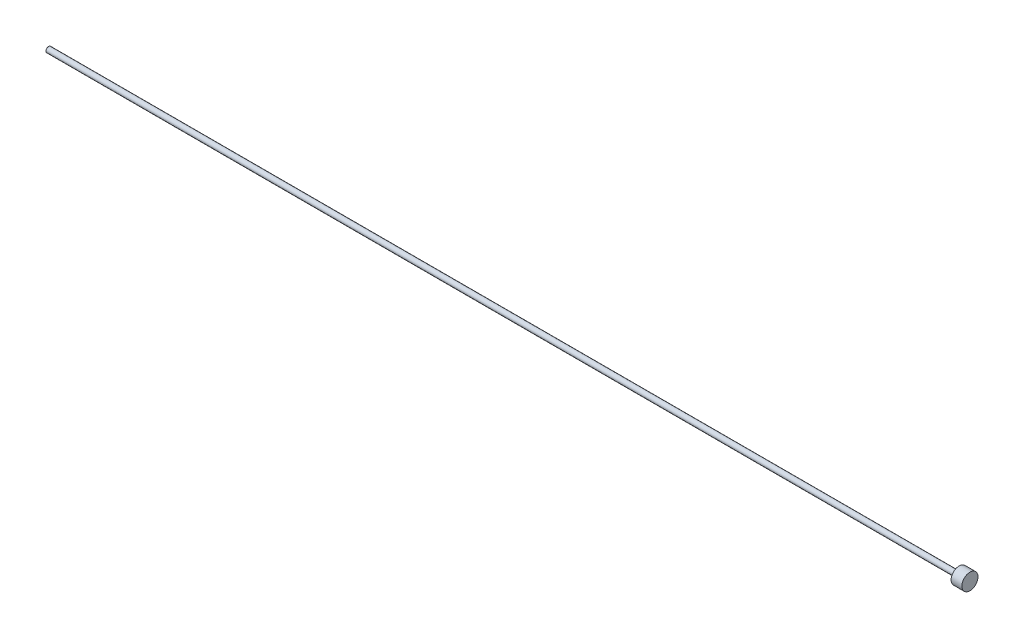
ISO-10303-21;
HEADER;
FILE_DESCRIPTION(('STEP AP214'),'2;1');
FILE_NAME('part.step','',(''),(''),'','','');
FILE_SCHEMA(('AUTOMOTIVE_DESIGN { 1 0 10303 214 1 1 1 1 }'));
ENDSEC;
DATA;
#1=APPLICATION_CONTEXT('core data for automotive mechanical design processes');
#2=APPLICATION_PROTOCOL_DEFINITION('international standard','automotive_design',2000,#1);
#3=PRODUCT_CONTEXT('',#1,'mechanical');
#4=PRODUCT('Part','Part','',(#3));
#5=PRODUCT_RELATED_PRODUCT_CATEGORY('part','',(#4));
#6=PRODUCT_DEFINITION_FORMATION('','',#4);
#7=PRODUCT_DEFINITION_CONTEXT('part definition',#1,'design');
#8=PRODUCT_DEFINITION('design','',#6,#7);
#9=PRODUCT_DEFINITION_SHAPE('','',#8);
#10=(LENGTH_UNIT() NAMED_UNIT(*) SI_UNIT(.MILLI.,.METRE.));
#11=(NAMED_UNIT(*) PLANE_ANGLE_UNIT() SI_UNIT($,.RADIAN.));
#12=(NAMED_UNIT(*) SI_UNIT($,.STERADIAN.) SOLID_ANGLE_UNIT());
#13=UNCERTAINTY_MEASURE_WITH_UNIT(LENGTH_MEASURE(1.E-05),#10,'distance_accuracy_value','');
#14=(GEOMETRIC_REPRESENTATION_CONTEXT(3) GLOBAL_UNCERTAINTY_ASSIGNED_CONTEXT((#13)) GLOBAL_UNIT_ASSIGNED_CONTEXT((#10,
#11,#12)) REPRESENTATION_CONTEXT('',''));
#15=CARTESIAN_POINT('',(0.,0.,0.));
#16=DIRECTION('',(0.,0.,1.));
#17=DIRECTION('',(1.,0.,0.));
#18=AXIS2_PLACEMENT_3D('',#15,#16,#17);
#19=CARTESIAN_POINT('',(294.909595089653,0.,0.));
#20=DIRECTION('',(1.,0.,0.));
#21=DIRECTION('',(0.,0.,-1.));
#22=AXIS2_PLACEMENT_3D('',#19,#20,#21);
#23=CYLINDRICAL_SURFACE('',#22,3.175);
#24=CARTESIAN_POINT('',(304.397851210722,0.,0.));
#25=DIRECTION('',(-1.,0.,0.));
#26=DIRECTION('',(0.,0.,1.));
#27=AXIS2_PLACEMENT_3D('',#24,#25,#26);
#28=CIRCLE('',#27,3.175);
#29=CARTESIAN_POINT('',(304.397851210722,0.,3.175));
#30=VERTEX_POINT('',#29);
#31=EDGE_CURVE('E10',#30,#30,#28,.F.);
#32=ORIENTED_EDGE('',*,*,#31,.T.);
#33=EDGE_LOOP('',(#32));
#34=FACE_BOUND('',#33,.T.);
#35=CARTESIAN_POINT('',(1377.48435121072,0.,0.));
#36=DIRECTION('',(-1.,0.,0.));
#37=DIRECTION('',(0.,0.,1.));
#38=AXIS2_PLACEMENT_3D('',#35,#36,#37);
#39=CIRCLE('',#38,3.175);
#40=CARTESIAN_POINT('',(1377.48435121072,0.,3.175));
#41=VERTEX_POINT('',#40);
#42=EDGE_CURVE('E42',#41,#41,#39,.T.);
#43=ORIENTED_EDGE('',*,*,#42,.T.);
#44=EDGE_LOOP('',(#43));
#45=FACE_BOUND('',#44,.T.);
#46=ADVANCED_FACE('F31',(#34,#45),#23,.T.);
#47=CARTESIAN_POINT('',(303.889851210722,0.,0.));
#48=DIRECTION('',(-1.,0.,0.));
#49=DIRECTION('',(0.,0.,1.));
#50=AXIS2_PLACEMENT_3D('',#47,#48,#49);
#51=PLANE('',#50);
#52=CARTESIAN_POINT('',(303.889851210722,0.,0.));
#53=DIRECTION('',(-1.,0.,0.));
#54=DIRECTION('',(0.,0.,1.));
#55=AXIS2_PLACEMENT_3D('',#52,#53,#54);
#56=CIRCLE('',#55,2.66699999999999);
#57=CARTESIAN_POINT('',(303.889851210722,0.,2.66699999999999));
#58=VERTEX_POINT('',#57);
#59=EDGE_CURVE('E38',#58,#58,#56,.T.);
#60=ORIENTED_EDGE('',*,*,#59,.T.);
#61=EDGE_LOOP('',(#60));
#62=FACE_BOUND('',#61,.T.);
#63=ADVANCED_FACE('F73',(#62),#51,.T.);
#64=CARTESIAN_POINT('',(1377.48435121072,0.,0.));
#65=DIRECTION('',(-1.,0.,0.));
#66=DIRECTION('',(0.,0.,1.));
#67=AXIS2_PLACEMENT_3D('',#64,#65,#66);
#68=PLANE('',#67);
#69=CARTESIAN_POINT('',(1377.48435121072,0.,0.));
#70=DIRECTION('',(-1.,0.,0.));
#71=DIRECTION('',(0.,0.,1.));
#72=AXIS2_PLACEMENT_3D('',#69,#70,#71);
#73=CIRCLE('',#72,9.52500000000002);
#74=CARTESIAN_POINT('',(1377.48435121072,0.,9.52500000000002));
#75=VERTEX_POINT('',#74);
#76=EDGE_CURVE('E46',#75,#75,#73,.T.);
#77=ORIENTED_EDGE('',*,*,#76,.T.);
#78=EDGE_LOOP('',(#77));
#79=FACE_BOUND('',#78,.T.);
#80=ORIENTED_EDGE('',*,*,#42,.F.);
#81=EDGE_LOOP('',(#80));
#82=FACE_BOUND('',#81,.T.);
#83=ADVANCED_FACE('F55',(#79,#82),#68,.T.);
#84=CARTESIAN_POINT('',(1377.48435121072,0.,0.));
#85=DIRECTION('',(1.,0.,0.));
#86=DIRECTION('',(0.,0.,-1.));
#87=AXIS2_PLACEMENT_3D('',#84,#85,#86);
#88=CYLINDRICAL_SURFACE('',#87,9.52500000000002);
#89=ORIENTED_EDGE('',*,*,#76,.F.);
#90=EDGE_LOOP('',(#89));
#91=FACE_BOUND('',#90,.T.);
#92=CARTESIAN_POINT('',(1390.18435121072,0.,0.));
#93=DIRECTION('',(-1.,0.,0.));
#94=DIRECTION('',(0.,0.,1.));
#95=AXIS2_PLACEMENT_3D('',#92,#93,#94);
#96=CIRCLE('',#95,9.52500000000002);
#97=CARTESIAN_POINT('',(1390.18435121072,0.,9.52500000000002));
#98=VERTEX_POINT('',#97);
#99=EDGE_CURVE('E49',#98,#98,#96,.T.);
#100=ORIENTED_EDGE('',*,*,#99,.T.);
#101=EDGE_LOOP('',(#100));
#102=FACE_BOUND('',#101,.T.);
#103=ADVANCED_FACE('F58',(#91,#102),#88,.T.);
#104=CARTESIAN_POINT('',(1390.18435121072,0.,0.));
#105=DIRECTION('',(-1.,0.,0.));
#106=DIRECTION('',(0.,0.,1.));
#107=AXIS2_PLACEMENT_3D('',#104,#105,#106);
#108=PLANE('',#107);
#109=ORIENTED_EDGE('',*,*,#99,.F.);
#110=EDGE_LOOP('',(#109));
#111=FACE_BOUND('',#110,.T.);
#112=ADVANCED_FACE('F61',(#111),#108,.F.);
#113=CARTESIAN_POINT('',(303.889851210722,0.,0.));
#114=DIRECTION('',(1.,0.,0.));
#115=DIRECTION('',(0.,0.,-1.));
#116=AXIS2_PLACEMENT_3D('',#113,#114,#115);
#117=CONICAL_SURFACE('',#116,2.66699999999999,0.785398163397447);
#118=ORIENTED_EDGE('',*,*,#31,.F.);
#119=EDGE_LOOP('',(#118));
#120=FACE_BOUND('',#119,.T.);
#121=ORIENTED_EDGE('',*,*,#59,.F.);
#122=EDGE_LOOP('',(#121));
#123=FACE_BOUND('',#122,.T.);
#124=ADVANCED_FACE('F33',(#120,#123),#117,.T.);
#125=CLOSED_SHELL('',(#46,#63,#83,#103,#112,#124));
#126=MANIFOLD_SOLID_BREP('B2',#125);
#127=ADVANCED_BREP_SHAPE_REPRESENTATION('',(#18,#126),#14);
#128=SHAPE_DEFINITION_REPRESENTATION(#9,#127);
ENDSEC;
END-ISO-10303-21;
